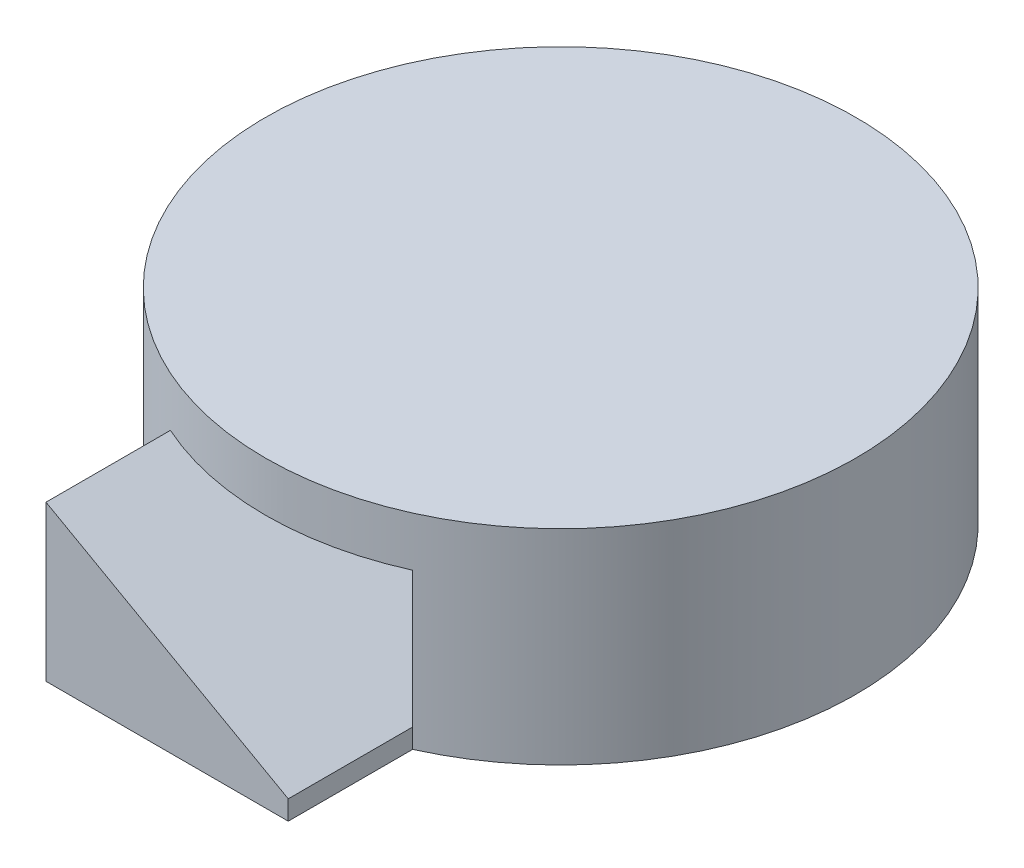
from build123d import *

# Parameters (mm, degrees)
SKETCH1_R           = 75
EXTRUDE1_DEPTH      = 52
EXTRUDE2_REACH      = 199.368
EXTRUDE2_END_RADIUS = 75
SKETCH3_W           = 61.550230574
SKETCH3_H           = 39.424610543
CUT_EXTRUDE2_REACH  = 199.368


with BuildPart() as part:
    # Sketch1 → Extrude1 (new body)
    with BuildSketch(Plane(origin=(0, 0, 0), x_dir=(1, 0, 0), z_dir=(0, 1, 0))):
        with Locations(Location((0, 0, 0), (0, 0, 270))):
            Circle(SKETCH1_R)
    extrude(amount=EXTRUDE1_DEPTH)

    # Extrude2: up to this cylinder (the profile starts outside it)
    extrude2_end = Plane(origin=(0, 19.712305, 0), z_dir=(0, -1, 0)) * Cylinder(EXTRUDE2_END_RADIUS, 549.736, mode=Mode.PRIVATE)
    # Sketch3 → Extrude2 (add, up to the surface)
    with BuildSketch(Plane.XY.offset(100), mode=Mode.PRIVATE) as extrude2_sk1:
        with Locations((0, 19.712305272)):
            Rectangle(SKETCH3_W, SKETCH3_H)
    extrude2_tool1 = extrude(extrude2_sk1.sketch, amount=-EXTRUDE2_REACH, mode=Mode.PRIVATE) - extrude2_end
    add(extrude2_tool1.solids().sort_by_distance((0, 19.712305, 100))[0])

    # Sketch4 → Cut-Extrude2 (cut, up to next)
    with BuildSketch(Plane.XY.offset(100), mode=Mode.PRIVATE) as cut_extrude2_sk1:
        Polygon((-30.775115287, 39.424610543), (30.775115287, 4.927105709), (30.775115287, 39.424610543), align=None)
    cut_extrude2_tool1 = extrude(cut_extrude2_sk1.sketch, amount=-CUT_EXTRUDE2_REACH, mode=Mode.PRIVATE) & part.part
    add(cut_extrude2_tool1.solids().sort_by_distance((10.258372, 27.925442, 100))[0], mode=Mode.SUBTRACT)


solid = part.part
